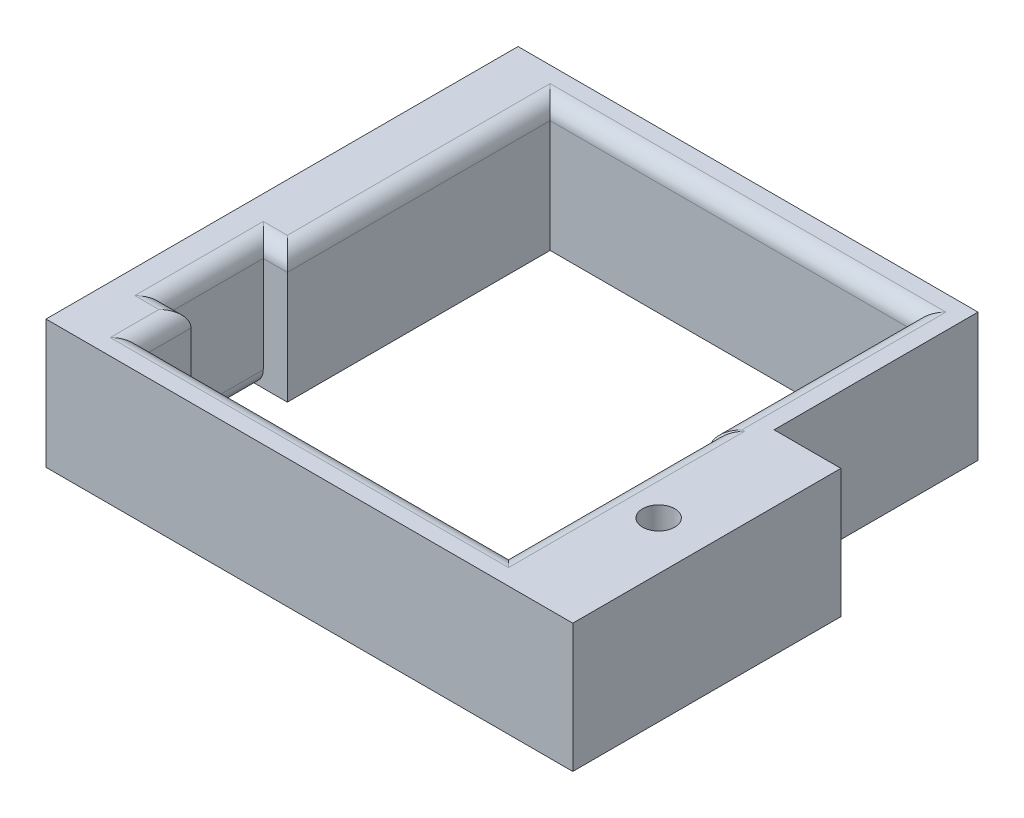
from build123d import *

# Parameters (mm, degrees)
BOSS_EXTRUDE1_DEPTH = 8
CUT_EXTRUDE1_DEPTH  = 45.775619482
SKETCH3_W           = 1.5
SKETCH3_H           = 6
SKETCH3_H_2         = 4.5
CUT_EXTRUDE2_DEPTH  = 45.775619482
FILLET1_R           = 1
FILLET2_R           = 1


with BuildPart() as part:
    # Sketch1 → Boss-Extrude1 (new body)
    with BuildSketch(Plane(origin=(0, 0, 0), x_dir=(1, 0, 0), z_dir=(0, 1, 0))):
        Polygon((0, 0), (0, 29.4), (28.65, 29.4), (28.65, 16.7), (32.81, 16.7), (32.81, 0), align=None)
        Polygon((26.81, 6.739099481), (26.81, 14.7), (26.65, 14.7), (26.65, 27.4), (4, 27.4), (4, 2), (26.81, 2), align=None, mode=Mode.SUBTRACT)
    extrude(amount=BOSS_EXTRUDE1_DEPTH)

    # Sketch2 → Cut-Extrude1 (cut, through all)
    with BuildSketch(Plane(origin=(0, 8, 0), x_dir=(1, 0, 0), z_dir=(0, 1, 0))):
        with BuildLine():
            ThreePointArc((30.237168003, 9.254172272), (29.81, 9.35), (29.382831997, 9.254172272))
            Line((29.382831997, 9.254172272), (29.81, 8.35))
            Line((29.81, 8.35), (30.237168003, 9.254172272))
        make_face()
        with BuildLine():
            Line((29.81, 8.35), (29.382831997, 9.254172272))
            ThreePointArc((29.382831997, 9.254172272), (28.81, 8.35), (29.382831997, 7.445827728))
            Line((29.382831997, 7.445827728), (29.81, 8.35))
        make_face()
        with BuildLine():
            ThreePointArc((30.81, 8.35), (30.654739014, 8.885178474), (30.237168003, 9.254172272))
            Line((30.237168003, 9.254172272), (29.81, 8.35))
            Line((29.81, 8.35), (30.237168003, 7.445827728))
            ThreePointArc((30.237168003, 7.445827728), (30.654739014, 7.814821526), (30.81, 8.35))
        make_face()
        with BuildLine():
            Line((29.81, 8.35), (29.382831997, 7.445827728))
            ThreePointArc((29.382831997, 7.445827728), (29.81, 7.35), (30.237168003, 7.445827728))
            Line((30.237168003, 7.445827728), (29.81, 8.35))
        make_face()
        with BuildLine():
            ThreePointArc((30.237168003, 9.254172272), (29.81, 9.35), (29.382831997, 9.254172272))
            Line((29.382831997, 9.254172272), (29.81, 8.35))
            Line((29.81, 8.35), (30.237168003, 9.254172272))
        make_face()
        with BuildLine():
            Line((29.81, 8.35), (29.382831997, 9.254172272))
            ThreePointArc((29.382831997, 9.254172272), (28.81, 8.35), (29.382831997, 7.445827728))
            Line((29.382831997, 7.445827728), (29.81, 8.35))
        make_face()
        with BuildLine():
            ThreePointArc((30.81, 8.35), (30.654739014, 8.885178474), (30.237168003, 9.254172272))
            Line((30.237168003, 9.254172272), (29.81, 8.35))
            Line((29.81, 8.35), (30.237168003, 7.445827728))
            ThreePointArc((30.237168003, 7.445827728), (30.654739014, 7.814821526), (30.81, 8.35))
        make_face()
        with BuildLine():
            Line((29.81, 8.35), (29.382831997, 7.445827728))
            ThreePointArc((29.382831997, 7.445827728), (29.81, 7.35), (30.237168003, 7.445827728))
            Line((30.237168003, 7.445827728), (29.81, 8.35))
        make_face()
        with BuildLine():
            ThreePointArc((30.237168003, 9.254172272), (29.81, 9.35), (29.382831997, 9.254172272))
            Line((29.382831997, 9.254172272), (29.81, 8.35))
            Line((29.81, 8.35), (30.237168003, 9.254172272))
        make_face()
        with BuildLine():
            Line((29.81, 8.35), (29.382831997, 9.254172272))
            ThreePointArc((29.382831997, 9.254172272), (28.81, 8.35), (29.382831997, 7.445827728))
            Line((29.382831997, 7.445827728), (29.81, 8.35))
        make_face()
        with BuildLine():
            ThreePointArc((30.81, 8.35), (30.654739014, 8.885178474), (30.237168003, 9.254172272))
            Line((30.237168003, 9.254172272), (29.81, 8.35))
            Line((29.81, 8.35), (30.237168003, 7.445827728))
            ThreePointArc((30.237168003, 7.445827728), (30.654739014, 7.814821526), (30.81, 8.35))
        make_face()
        with BuildLine():
            Line((29.81, 8.35), (29.382831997, 7.445827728))
            ThreePointArc((29.382831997, 7.445827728), (29.81, 7.35), (30.237168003, 7.445827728))
            Line((30.237168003, 7.445827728), (29.81, 8.35))
        make_face()
        with BuildLine():
            ThreePointArc((30.237168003, 9.254172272), (29.81, 9.35), (29.382831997, 9.254172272))
            Line((29.382831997, 9.254172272), (29.81, 8.35))
            Line((29.81, 8.35), (30.237168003, 9.254172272))
        make_face()
        with BuildLine():
            Line((29.81, 8.35), (29.382831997, 9.254172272))
            ThreePointArc((29.382831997, 9.254172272), (28.81, 8.35), (29.382831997, 7.445827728))
            Line((29.382831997, 7.445827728), (29.81, 8.35))
        make_face()
        with BuildLine():
            ThreePointArc((30.81, 8.35), (30.654739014, 8.885178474), (30.237168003, 9.254172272))
            Line((30.237168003, 9.254172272), (29.81, 8.35))
            Line((29.81, 8.35), (30.237168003, 7.445827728))
            ThreePointArc((30.237168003, 7.445827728), (30.654739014, 7.814821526), (30.81, 8.35))
        make_face()
        with BuildLine():
            Line((29.81, 8.35), (29.382831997, 7.445827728))
            ThreePointArc((29.382831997, 7.445827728), (29.81, 7.35), (30.237168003, 7.445827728))
            Line((30.237168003, 7.445827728), (29.81, 8.35))
        make_face()
    extrude(amount=-CUT_EXTRUDE1_DEPTH, mode=Mode.SUBTRACT)

    # Sketch3 → Cut-Extrude2 (cut, through all)
    with BuildSketch(Plane(origin=(0, 8, 0), x_dir=(1, 0, 0), z_dir=(0, 1, 0))):
        with Locations((3.25, 8.031511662)):
            Rectangle(SKETCH3_W, SKETCH3_H)
        with Locations((-0.75, 8)):
            Rectangle(SKETCH3_W, SKETCH3_H_2)
    extrude(amount=-CUT_EXTRUDE2_DEPTH, mode=Mode.SUBTRACT)

    # Fillet1
    fillet1_edges = [part.edges().sort_by_distance(p)[0] for p in [
        (26.81, 8, -8.35),
        (26.73, 8, -14.7),
        (26.65, 8, -21.05),
        (15.325, 8, -27.4),
        (4, 8, -19.215755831),
        (15.405, 8, -2),
        (4, 8, -3.515755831),
        (3.25, 8, -11.031511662),
        (2.5, 8, -8.031511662),
        (3.25, 8, -5.031511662),
    ]]
    fillet(fillet1_edges, radius=FILLET1_R)

    # Fillet2
    fillet2_edges = [part.edges().sort_by_distance(p)[0] for p in [
        (2.5, 0, -8.031511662),
    ]]
    fillet(fillet2_edges, radius=FILLET2_R)


solid = part.part
